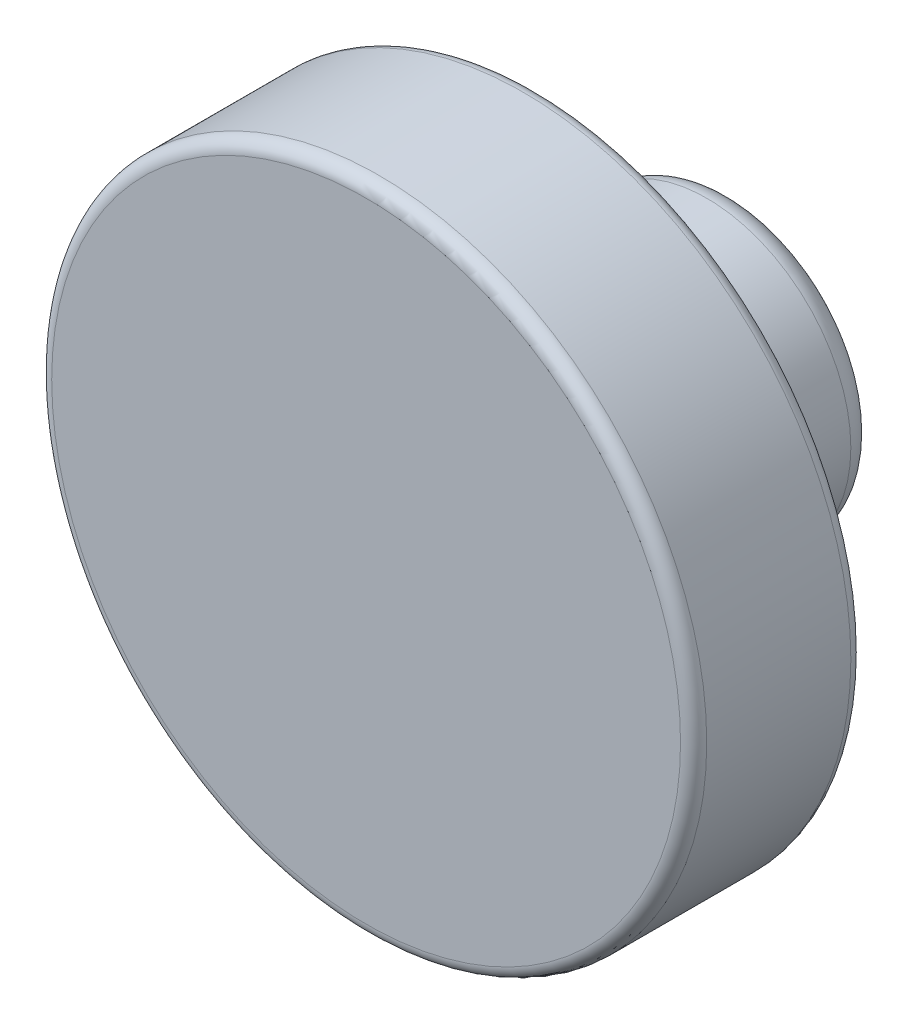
ISO-10303-21;
HEADER;
FILE_DESCRIPTION(('STEP AP214'),'2;1');
FILE_NAME('part.step','',(''),(''),'','','');
FILE_SCHEMA(('AUTOMOTIVE_DESIGN { 1 0 10303 214 1 1 1 1 }'));
ENDSEC;
DATA;
#1=APPLICATION_CONTEXT('core data for automotive mechanical design processes');
#2=APPLICATION_PROTOCOL_DEFINITION('international standard','automotive_design',2000,#1);
#3=PRODUCT_CONTEXT('',#1,'mechanical');
#4=PRODUCT('Part','Part','',(#3));
#5=PRODUCT_RELATED_PRODUCT_CATEGORY('part','',(#4));
#6=PRODUCT_DEFINITION_FORMATION('','',#4);
#7=PRODUCT_DEFINITION_CONTEXT('part definition',#1,'design');
#8=PRODUCT_DEFINITION('design','',#6,#7);
#9=PRODUCT_DEFINITION_SHAPE('','',#8);
#10=(LENGTH_UNIT() NAMED_UNIT(*) SI_UNIT(.MILLI.,.METRE.));
#11=(NAMED_UNIT(*) PLANE_ANGLE_UNIT() SI_UNIT($,.RADIAN.));
#12=(NAMED_UNIT(*) SI_UNIT($,.STERADIAN.) SOLID_ANGLE_UNIT());
#13=UNCERTAINTY_MEASURE_WITH_UNIT(LENGTH_MEASURE(1.E-05),#10,'distance_accuracy_value','');
#14=(GEOMETRIC_REPRESENTATION_CONTEXT(3) GLOBAL_UNCERTAINTY_ASSIGNED_CONTEXT((#13)) GLOBAL_UNIT_ASSIGNED_CONTEXT((#10,
#11,#12)) REPRESENTATION_CONTEXT('',''));
#15=CARTESIAN_POINT('',(0.,0.,0.));
#16=DIRECTION('',(0.,0.,1.));
#17=DIRECTION('',(1.,0.,0.));
#18=AXIS2_PLACEMENT_3D('',#15,#16,#17);
#19=CARTESIAN_POINT('',(0.,5.,18.));
#20=DIRECTION('',(0.,0.,1.));
#21=DIRECTION('',(1.,0.,0.));
#22=AXIS2_PLACEMENT_3D('',#19,#20,#21);
#23=PLANE('',#22);
#24=CARTESIAN_POINT('',(0.,0.,18.));
#25=DIRECTION('',(0.,0.,1.));
#26=DIRECTION('',(1.,0.,0.));
#27=AXIS2_PLACEMENT_3D('',#24,#25,#26);
#28=CIRCLE('',#27,5.);
#29=CARTESIAN_POINT('',(5.,0.,18.));
#30=VERTEX_POINT('',#29);
#31=EDGE_CURVE('E8',#30,#30,#28,.T.);
#32=ORIENTED_EDGE('',*,*,#31,.F.);
#33=EDGE_LOOP('',(#32));
#34=FACE_BOUND('',#33,.T.);
#35=ADVANCED_FACE('F12',(#34),#23,.F.);
#36=CARTESIAN_POINT('',(0.,0.,33.));
#37=DIRECTION('',(0.,0.,1.));
#38=DIRECTION('',(1.,0.,0.));
#39=AXIS2_PLACEMENT_3D('',#36,#37,#38);
#40=CYLINDRICAL_SURFACE('',#39,5.);
#41=CARTESIAN_POINT('',(0.,0.,0.));
#42=DIRECTION('',(0.,0.,1.));
#43=DIRECTION('',(1.,0.,0.));
#44=AXIS2_PLACEMENT_3D('',#41,#42,#43);
#45=CIRCLE('',#44,5.);
#46=CARTESIAN_POINT('',(5.,0.,0.));
#47=VERTEX_POINT('',#46);
#48=EDGE_CURVE('E18',#47,#47,#45,.T.);
#49=ORIENTED_EDGE('',*,*,#48,.F.);
#50=EDGE_LOOP('',(#49));
#51=FACE_BOUND('',#50,.T.);
#52=ORIENTED_EDGE('',*,*,#31,.T.);
#53=EDGE_LOOP('',(#52));
#54=FACE_BOUND('',#53,.T.);
#55=ADVANCED_FACE('F96',(#51,#54),#40,.F.);
#56=CARTESIAN_POINT('',(0.,9.,0.));
#57=DIRECTION('',(0.,0.,1.));
#58=DIRECTION('',(1.,0.,0.));
#59=AXIS2_PLACEMENT_3D('',#56,#57,#58);
#60=PLANE('',#59);
#61=CARTESIAN_POINT('',(0.,0.,0.));
#62=DIRECTION('',(0.,0.,1.));
#63=DIRECTION('',(1.,0.,0.));
#64=AXIS2_PLACEMENT_3D('',#61,#62,#63);
#65=CIRCLE('',#64,9.);
#66=CARTESIAN_POINT('',(9.,0.,0.));
#67=VERTEX_POINT('',#66);
#68=EDGE_CURVE('E22',#67,#67,#65,.T.);
#69=ORIENTED_EDGE('',*,*,#68,.F.);
#70=EDGE_LOOP('',(#69));
#71=FACE_BOUND('',#70,.T.);
#72=ORIENTED_EDGE('',*,*,#48,.T.);
#73=EDGE_LOOP('',(#72));
#74=FACE_BOUND('',#73,.T.);
#75=ADVANCED_FACE('F91',(#71,#74),#60,.F.);
#76=CARTESIAN_POINT('',(0.,0.,2.));
#77=DIRECTION('',(0.,0.,1.));
#78=DIRECTION('',(1.,0.,0.));
#79=AXIS2_PLACEMENT_3D('',#76,#77,#78);
#80=TOROIDAL_SURFACE('',#79,9.,2.);
#81=CARTESIAN_POINT('',(0.,0.,2.));
#82=DIRECTION('',(0.,0.,1.));
#83=DIRECTION('',(1.,0.,0.));
#84=AXIS2_PLACEMENT_3D('',#81,#82,#83);
#85=CIRCLE('',#84,11.);
#86=CARTESIAN_POINT('',(11.,0.,2.));
#87=VERTEX_POINT('',#86);
#88=EDGE_CURVE('E26',#87,#87,#85,.T.);
#89=ORIENTED_EDGE('',*,*,#88,.F.);
#90=EDGE_LOOP('',(#89));
#91=FACE_BOUND('',#90,.T.);
#92=ORIENTED_EDGE('',*,*,#68,.T.);
#93=EDGE_LOOP('',(#92));
#94=FACE_BOUND('',#93,.T.);
#95=ADVANCED_FACE('F85',(#91,#94),#80,.T.);
#96=CARTESIAN_POINT('',(0.,0.,33.));
#97=DIRECTION('',(0.,0.,1.));
#98=DIRECTION('',(1.,0.,0.));
#99=AXIS2_PLACEMENT_3D('',#96,#97,#98);
#100=CYLINDRICAL_SURFACE('',#99,11.);
#101=CARTESIAN_POINT('',(0.,0.,12.));
#102=DIRECTION('',(0.,0.,1.));
#103=DIRECTION('',(1.,0.,0.));
#104=AXIS2_PLACEMENT_3D('',#101,#102,#103);
#105=CIRCLE('',#104,11.);
#106=CARTESIAN_POINT('',(11.,0.,12.));
#107=VERTEX_POINT('',#106);
#108=EDGE_CURVE('E31',#107,#107,#105,.T.);
#109=ORIENTED_EDGE('',*,*,#108,.F.);
#110=EDGE_LOOP('',(#109));
#111=FACE_BOUND('',#110,.T.);
#112=ORIENTED_EDGE('',*,*,#88,.T.);
#113=EDGE_LOOP('',(#112));
#114=FACE_BOUND('',#113,.T.);
#115=ADVANCED_FACE('F79',(#111,#114),#100,.T.);
#116=CARTESIAN_POINT('',(0.,0.,12.));
#117=DIRECTION('',(0.,0.,1.));
#118=DIRECTION('',(1.,0.,0.));
#119=AXIS2_PLACEMENT_3D('',#116,#117,#118);
#120=TOROIDAL_SURFACE('',#119,14.,3.);
#121=CARTESIAN_POINT('',(0.,0.,15.));
#122=DIRECTION('',(0.,0.,1.));
#123=DIRECTION('',(1.,0.,0.));
#124=AXIS2_PLACEMENT_3D('',#121,#122,#123);
#125=CIRCLE('',#124,14.);
#126=CARTESIAN_POINT('',(14.,0.,15.));
#127=VERTEX_POINT('',#126);
#128=EDGE_CURVE('E34',#127,#127,#125,.T.);
#129=ORIENTED_EDGE('',*,*,#128,.F.);
#130=EDGE_LOOP('',(#129));
#131=FACE_BOUND('',#130,.T.);
#132=ORIENTED_EDGE('',*,*,#108,.T.);
#133=EDGE_LOOP('',(#132));
#134=FACE_BOUND('',#133,.T.);
#135=ADVANCED_FACE('F73',(#131,#134),#120,.F.);
#136=CARTESIAN_POINT('',(0.,24.,15.));
#137=DIRECTION('',(0.,0.,1.));
#138=DIRECTION('',(1.,0.,0.));
#139=AXIS2_PLACEMENT_3D('',#136,#137,#138);
#140=PLANE('',#139);
#141=CARTESIAN_POINT('',(0.,0.,15.));
#142=DIRECTION('',(0.,0.,1.));
#143=DIRECTION('',(1.,0.,0.));
#144=AXIS2_PLACEMENT_3D('',#141,#142,#143);
#145=CIRCLE('',#144,24.);
#146=CARTESIAN_POINT('',(24.,0.,15.));
#147=VERTEX_POINT('',#146);
#148=EDGE_CURVE('E37',#147,#147,#145,.T.);
#149=ORIENTED_EDGE('',*,*,#148,.F.);
#150=EDGE_LOOP('',(#149));
#151=FACE_BOUND('',#150,.T.);
#152=ORIENTED_EDGE('',*,*,#128,.T.);
#153=EDGE_LOOP('',(#152));
#154=FACE_BOUND('',#153,.T.);
#155=ADVANCED_FACE('F67',(#151,#154),#140,.F.);
#156=CARTESIAN_POINT('',(0.,0.,16.));
#157=DIRECTION('',(0.,0.,1.));
#158=DIRECTION('',(1.,0.,0.));
#159=AXIS2_PLACEMENT_3D('',#156,#157,#158);
#160=TOROIDAL_SURFACE('',#159,24.,1.00000000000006);
#161=CARTESIAN_POINT('',(0.,0.,16.));
#162=DIRECTION('',(0.,0.,1.));
#163=DIRECTION('',(1.,0.,0.));
#164=AXIS2_PLACEMENT_3D('',#161,#162,#163);
#165=CIRCLE('',#164,25.);
#166=CARTESIAN_POINT('',(25.,0.,16.));
#167=VERTEX_POINT('',#166);
#168=EDGE_CURVE('E40',#167,#167,#165,.T.);
#169=ORIENTED_EDGE('',*,*,#168,.F.);
#170=EDGE_LOOP('',(#169));
#171=FACE_BOUND('',#170,.T.);
#172=ORIENTED_EDGE('',*,*,#148,.T.);
#173=EDGE_LOOP('',(#172));
#174=FACE_BOUND('',#173,.T.);
#175=ADVANCED_FACE('F61',(#171,#174),#160,.T.);
#176=CARTESIAN_POINT('',(0.,0.,33.));
#177=DIRECTION('',(0.,0.,1.));
#178=DIRECTION('',(1.,0.,0.));
#179=AXIS2_PLACEMENT_3D('',#176,#177,#178);
#180=CYLINDRICAL_SURFACE('',#179,25.);
#181=CARTESIAN_POINT('',(0.,0.,27.));
#182=DIRECTION('',(0.,0.,1.));
#183=DIRECTION('',(1.,0.,0.));
#184=AXIS2_PLACEMENT_3D('',#181,#182,#183);
#185=CIRCLE('',#184,25.);
#186=CARTESIAN_POINT('',(25.,0.,27.));
#187=VERTEX_POINT('',#186);
#188=EDGE_CURVE('E43',#187,#187,#185,.T.);
#189=ORIENTED_EDGE('',*,*,#188,.F.);
#190=EDGE_LOOP('',(#189));
#191=FACE_BOUND('',#190,.T.);
#192=ORIENTED_EDGE('',*,*,#168,.T.);
#193=EDGE_LOOP('',(#192));
#194=FACE_BOUND('',#193,.T.);
#195=ADVANCED_FACE('F55',(#191,#194),#180,.T.);
#196=CARTESIAN_POINT('',(0.,0.,27.));
#197=DIRECTION('',(0.,0.,1.));
#198=DIRECTION('',(1.,0.,0.));
#199=AXIS2_PLACEMENT_3D('',#196,#197,#198);
#200=TOROIDAL_SURFACE('',#199,24.,0.999999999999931);
#201=CARTESIAN_POINT('',(0.,0.,28.));
#202=DIRECTION('',(0.,0.,1.));
#203=DIRECTION('',(1.,0.,0.));
#204=AXIS2_PLACEMENT_3D('',#201,#202,#203);
#205=CIRCLE('',#204,24.);
#206=CARTESIAN_POINT('',(24.,0.,28.));
#207=VERTEX_POINT('',#206);
#208=EDGE_CURVE('E46',#207,#207,#205,.T.);
#209=ORIENTED_EDGE('',*,*,#208,.F.);
#210=EDGE_LOOP('',(#209));
#211=FACE_BOUND('',#210,.T.);
#212=ORIENTED_EDGE('',*,*,#188,.T.);
#213=EDGE_LOOP('',(#212));
#214=FACE_BOUND('',#213,.T.);
#215=ADVANCED_FACE('F52',(#211,#214),#200,.T.);
#216=CARTESIAN_POINT('',(0.,24.,28.));
#217=DIRECTION('',(0.,0.,-1.));
#218=DIRECTION('',(-1.,0.,0.));
#219=AXIS2_PLACEMENT_3D('',#216,#217,#218);
#220=PLANE('',#219);
#221=ORIENTED_EDGE('',*,*,#208,.T.);
#222=EDGE_LOOP('',(#221));
#223=FACE_BOUND('',#222,.T.);
#224=ADVANCED_FACE('F50',(#223),#220,.F.);
#225=CLOSED_SHELL('',(#35,#55,#75,#95,#115,#135,#155,#175,#195,#215,#224));
#226=MANIFOLD_SOLID_BREP('B1',#225);
#227=ADVANCED_BREP_SHAPE_REPRESENTATION('',(#18,#226),#14);
#228=SHAPE_DEFINITION_REPRESENTATION(#9,#227);
ENDSEC;
END-ISO-10303-21;
